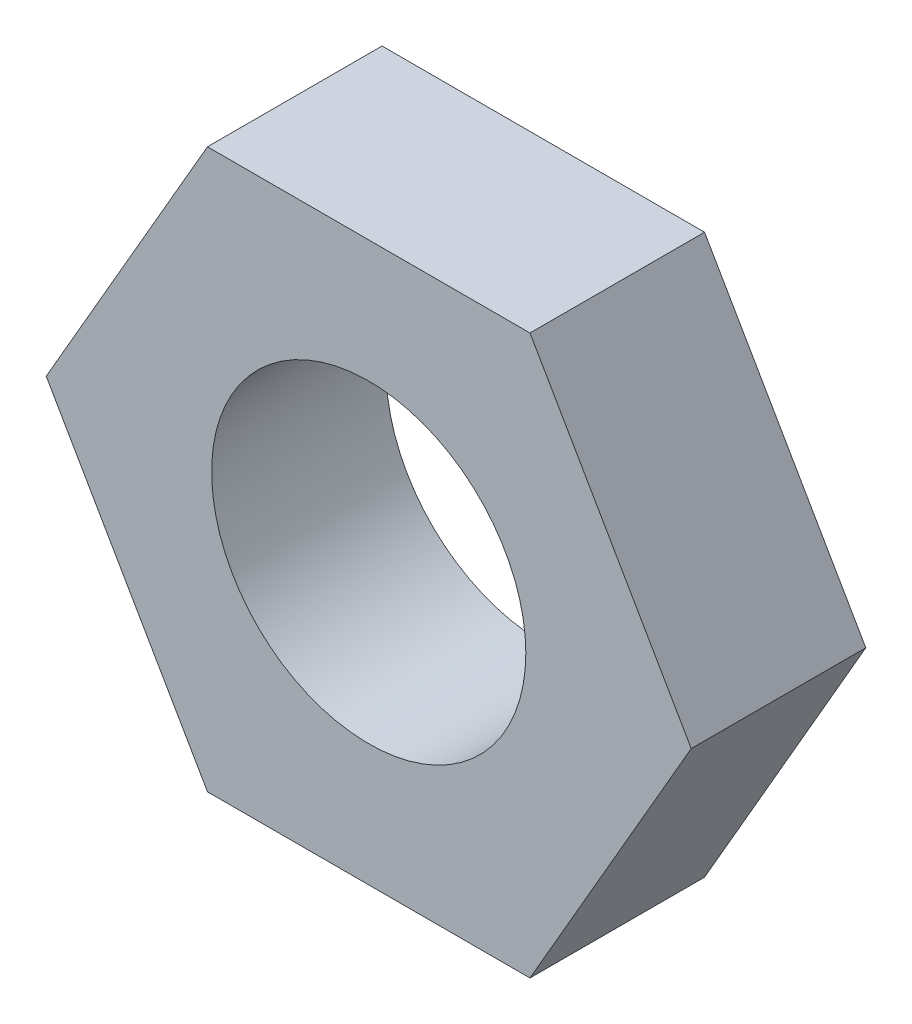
ISO-10303-21;
HEADER;
FILE_DESCRIPTION(('STEP AP214'),'2;1');
FILE_NAME('part.step','',(''),(''),'','','');
FILE_SCHEMA(('AUTOMOTIVE_DESIGN { 1 0 10303 214 1 1 1 1 }'));
ENDSEC;
DATA;
#1=APPLICATION_CONTEXT('core data for automotive mechanical design processes');
#2=APPLICATION_PROTOCOL_DEFINITION('international standard','automotive_design',2000,#1);
#3=PRODUCT_CONTEXT('',#1,'mechanical');
#4=PRODUCT('Part','Part','',(#3));
#5=PRODUCT_RELATED_PRODUCT_CATEGORY('part','',(#4));
#6=PRODUCT_DEFINITION_FORMATION('','',#4);
#7=PRODUCT_DEFINITION_CONTEXT('part definition',#1,'design');
#8=PRODUCT_DEFINITION('design','',#6,#7);
#9=PRODUCT_DEFINITION_SHAPE('','',#8);
#10=(LENGTH_UNIT() NAMED_UNIT(*) SI_UNIT(.MILLI.,.METRE.));
#11=(NAMED_UNIT(*) PLANE_ANGLE_UNIT() SI_UNIT($,.RADIAN.));
#12=(NAMED_UNIT(*) SI_UNIT($,.STERADIAN.) SOLID_ANGLE_UNIT());
#13=UNCERTAINTY_MEASURE_WITH_UNIT(LENGTH_MEASURE(1.E-05),#10,'distance_accuracy_value','');
#14=(GEOMETRIC_REPRESENTATION_CONTEXT(3) GLOBAL_UNCERTAINTY_ASSIGNED_CONTEXT((#13)) GLOBAL_UNIT_ASSIGNED_CONTEXT((#10,
#11,#12)) REPRESENTATION_CONTEXT('',''));
#15=CARTESIAN_POINT('',(0.,0.,0.));
#16=DIRECTION('',(0.,0.,1.));
#17=DIRECTION('',(1.,0.,0.));
#18=AXIS2_PLACEMENT_3D('',#15,#16,#17);
#19=CARTESIAN_POINT('',(-4.618802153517,-8.,-5.));
#20=DIRECTION('',(0.,-1.,0.));
#21=DIRECTION('',(0.,0.,-1.));
#22=AXIS2_PLACEMENT_3D('',#19,#20,#21);
#23=PLANE('',#22);
#24=DIRECTION('',(1.,0.,0.));
#25=VECTOR('',#24,1.);
#26=CARTESIAN_POINT('',(-4.618802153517,-8.,0.));
#27=LINE('',#26,#25);
#28=CARTESIAN_POINT('',(-4.618802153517,-8.,0.));
#29=VERTEX_POINT('',#28);
#30=CARTESIAN_POINT('',(4.61880215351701,-8.,0.));
#31=VERTEX_POINT('',#30);
#32=EDGE_CURVE('E119',#29,#31,#27,.T.);
#33=ORIENTED_EDGE('',*,*,#32,.F.);
#34=DIRECTION('',(0.,0.,1.));
#35=VECTOR('',#34,1.);
#36=CARTESIAN_POINT('',(-4.618802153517,-8.,-5.));
#37=LINE('',#36,#35);
#38=CARTESIAN_POINT('',(-4.618802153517,-8.,-5.));
#39=VERTEX_POINT('',#38);
#40=EDGE_CURVE('E11',#39,#29,#37,.T.);
#41=ORIENTED_EDGE('',*,*,#40,.F.);
#42=DIRECTION('',(1.,0.,0.));
#43=VECTOR('',#42,1.);
#44=CARTESIAN_POINT('',(-4.618802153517,-8.,-5.));
#45=LINE('',#44,#43);
#46=CARTESIAN_POINT('',(4.61880215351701,-8.,-5.));
#47=VERTEX_POINT('',#46);
#48=EDGE_CURVE('E134',#39,#47,#45,.T.);
#49=ORIENTED_EDGE('',*,*,#48,.T.);
#50=DIRECTION('',(0.,0.,1.));
#51=VECTOR('',#50,1.);
#52=CARTESIAN_POINT('',(4.61880215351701,-8.,-5.));
#53=LINE('',#52,#51);
#54=EDGE_CURVE('E37',#47,#31,#53,.T.);
#55=ORIENTED_EDGE('',*,*,#54,.T.);
#56=EDGE_LOOP('',(#33,#41,#49,#55));
#57=FACE_BOUND('',#56,.T.);
#58=ADVANCED_FACE('F34',(#57),#23,.T.);
#59=CARTESIAN_POINT('',(-9.23760430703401,0.,-5.));
#60=DIRECTION('',(-0.866025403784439,-0.5,0.));
#61=DIRECTION('',(0.5,-0.866025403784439,0.));
#62=AXIS2_PLACEMENT_3D('',#59,#60,#61);
#63=PLANE('',#62);
#64=DIRECTION('',(0.5,-0.866025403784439,0.));
#65=VECTOR('',#64,1.);
#66=CARTESIAN_POINT('',(-9.23760430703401,0.,0.));
#67=LINE('',#66,#65);
#68=CARTESIAN_POINT('',(-9.23760430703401,0.,0.));
#69=VERTEX_POINT('',#68);
#70=EDGE_CURVE('E132',#69,#29,#67,.T.);
#71=ORIENTED_EDGE('',*,*,#70,.F.);
#72=DIRECTION('',(0.,0.,1.));
#73=VECTOR('',#72,1.);
#74=CARTESIAN_POINT('',(-9.23760430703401,0.,-5.));
#75=LINE('',#74,#73);
#76=CARTESIAN_POINT('',(-9.23760430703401,0.,-5.));
#77=VERTEX_POINT('',#76);
#78=EDGE_CURVE('E43',#77,#69,#75,.T.);
#79=ORIENTED_EDGE('',*,*,#78,.F.);
#80=DIRECTION('',(0.5,-0.866025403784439,0.));
#81=VECTOR('',#80,1.);
#82=CARTESIAN_POINT('',(-9.23760430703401,0.,-5.));
#83=LINE('',#82,#81);
#84=EDGE_CURVE('E109',#77,#39,#83,.T.);
#85=ORIENTED_EDGE('',*,*,#84,.T.);
#86=ORIENTED_EDGE('',*,*,#40,.T.);
#87=EDGE_LOOP('',(#71,#79,#85,#86));
#88=FACE_BOUND('',#87,.T.);
#89=ADVANCED_FACE('F142',(#88),#63,.T.);
#90=CARTESIAN_POINT('',(-4.61880215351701,8.,-5.));
#91=DIRECTION('',(-0.866025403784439,0.5,0.));
#92=DIRECTION('',(-0.5,-0.866025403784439,0.));
#93=AXIS2_PLACEMENT_3D('',#90,#91,#92);
#94=PLANE('',#93);
#95=DIRECTION('',(-0.5,-0.866025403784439,0.));
#96=VECTOR('',#95,1.);
#97=CARTESIAN_POINT('',(-4.61880215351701,8.,0.));
#98=LINE('',#97,#96);
#99=CARTESIAN_POINT('',(-4.61880215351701,8.,0.));
#100=VERTEX_POINT('',#99);
#101=EDGE_CURVE('E96',#100,#69,#98,.T.);
#102=ORIENTED_EDGE('',*,*,#101,.F.);
#103=DIRECTION('',(0.,0.,1.));
#104=VECTOR('',#103,1.);
#105=CARTESIAN_POINT('',(-4.61880215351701,8.,-5.));
#106=LINE('',#105,#104);
#107=CARTESIAN_POINT('',(-4.61880215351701,8.,-5.));
#108=VERTEX_POINT('',#107);
#109=EDGE_CURVE('E91',#108,#100,#106,.T.);
#110=ORIENTED_EDGE('',*,*,#109,.F.);
#111=DIRECTION('',(-0.5,-0.866025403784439,0.));
#112=VECTOR('',#111,1.);
#113=CARTESIAN_POINT('',(-4.61880215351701,8.,-5.));
#114=LINE('',#113,#112);
#115=EDGE_CURVE('E94',#108,#77,#114,.T.);
#116=ORIENTED_EDGE('',*,*,#115,.T.);
#117=ORIENTED_EDGE('',*,*,#78,.T.);
#118=EDGE_LOOP('',(#102,#110,#116,#117));
#119=FACE_BOUND('',#118,.T.);
#120=ADVANCED_FACE('F93',(#119),#94,.T.);
#121=CARTESIAN_POINT('',(4.61880215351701,8.,-5.));
#122=DIRECTION('',(0.,1.,0.));
#123=DIRECTION('',(0.,0.,1.));
#124=AXIS2_PLACEMENT_3D('',#121,#122,#123);
#125=PLANE('',#124);
#126=DIRECTION('',(-1.,0.,0.));
#127=VECTOR('',#126,1.);
#128=CARTESIAN_POINT('',(4.61880215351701,8.,0.));
#129=LINE('',#128,#127);
#130=CARTESIAN_POINT('',(4.61880215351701,8.,0.));
#131=VERTEX_POINT('',#130);
#132=EDGE_CURVE('E129',#131,#100,#129,.T.);
#133=ORIENTED_EDGE('',*,*,#132,.F.);
#134=DIRECTION('',(0.,0.,1.));
#135=VECTOR('',#134,1.);
#136=CARTESIAN_POINT('',(4.61880215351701,8.,-5.));
#137=LINE('',#136,#135);
#138=CARTESIAN_POINT('',(4.61880215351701,8.,-5.));
#139=VERTEX_POINT('',#138);
#140=EDGE_CURVE('E101',#139,#131,#137,.T.);
#141=ORIENTED_EDGE('',*,*,#140,.F.);
#142=DIRECTION('',(-1.,0.,0.));
#143=VECTOR('',#142,1.);
#144=CARTESIAN_POINT('',(4.61880215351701,8.,-5.));
#145=LINE('',#144,#143);
#146=EDGE_CURVE('E107',#139,#108,#145,.T.);
#147=ORIENTED_EDGE('',*,*,#146,.T.);
#148=ORIENTED_EDGE('',*,*,#109,.T.);
#149=EDGE_LOOP('',(#133,#141,#147,#148));
#150=FACE_BOUND('',#149,.T.);
#151=ADVANCED_FACE('F111',(#150),#125,.T.);
#152=CARTESIAN_POINT('',(9.23760430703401,0.,-5.));
#153=DIRECTION('',(0.866025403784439,0.5,0.));
#154=DIRECTION('',(-0.5,0.866025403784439,0.));
#155=AXIS2_PLACEMENT_3D('',#152,#153,#154);
#156=PLANE('',#155);
#157=DIRECTION('',(-0.5,0.866025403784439,0.));
#158=VECTOR('',#157,1.);
#159=CARTESIAN_POINT('',(9.23760430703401,0.,0.));
#160=LINE('',#159,#158);
#161=CARTESIAN_POINT('',(9.23760430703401,0.,0.));
#162=VERTEX_POINT('',#161);
#163=EDGE_CURVE('E126',#162,#131,#160,.T.);
#164=ORIENTED_EDGE('',*,*,#163,.F.);
#165=DIRECTION('',(0.,0.,1.));
#166=VECTOR('',#165,1.);
#167=CARTESIAN_POINT('',(9.23760430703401,0.,-5.));
#168=LINE('',#167,#166);
#169=CARTESIAN_POINT('',(9.23760430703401,0.,-5.));
#170=VERTEX_POINT('',#169);
#171=EDGE_CURVE('E137',#170,#162,#168,.T.);
#172=ORIENTED_EDGE('',*,*,#171,.F.);
#173=DIRECTION('',(-0.5,0.866025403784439,0.));
#174=VECTOR('',#173,1.);
#175=CARTESIAN_POINT('',(9.23760430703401,0.,-5.));
#176=LINE('',#175,#174);
#177=EDGE_CURVE('E112',#170,#139,#176,.T.);
#178=ORIENTED_EDGE('',*,*,#177,.T.);
#179=ORIENTED_EDGE('',*,*,#140,.T.);
#180=EDGE_LOOP('',(#164,#172,#178,#179));
#181=FACE_BOUND('',#180,.T.);
#182=ADVANCED_FACE('F155',(#181),#156,.T.);
#183=CARTESIAN_POINT('',(4.61880215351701,-8.,-5.));
#184=DIRECTION('',(0.866025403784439,-0.5,0.));
#185=DIRECTION('',(0.5,0.866025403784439,0.));
#186=AXIS2_PLACEMENT_3D('',#183,#184,#185);
#187=PLANE('',#186);
#188=DIRECTION('',(0.5,0.866025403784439,0.));
#189=VECTOR('',#188,1.);
#190=CARTESIAN_POINT('',(4.61880215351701,-8.,0.));
#191=LINE('',#190,#189);
#192=EDGE_CURVE('E122',#31,#162,#191,.T.);
#193=ORIENTED_EDGE('',*,*,#192,.F.);
#194=ORIENTED_EDGE('',*,*,#54,.F.);
#195=DIRECTION('',(0.5,0.866025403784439,0.));
#196=VECTOR('',#195,1.);
#197=CARTESIAN_POINT('',(4.61880215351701,-8.,-5.));
#198=LINE('',#197,#196);
#199=EDGE_CURVE('E114',#47,#170,#198,.T.);
#200=ORIENTED_EDGE('',*,*,#199,.T.);
#201=ORIENTED_EDGE('',*,*,#171,.T.);
#202=EDGE_LOOP('',(#193,#194,#200,#201));
#203=FACE_BOUND('',#202,.T.);
#204=ADVANCED_FACE('F139',(#203),#187,.T.);
#205=CARTESIAN_POINT('',(-4.618802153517,-8.,-5.));
#206=DIRECTION('',(0.,0.,-1.));
#207=DIRECTION('',(-1.,0.,0.));
#208=AXIS2_PLACEMENT_3D('',#205,#206,#207);
#209=PLANE('',#208);
#210=CARTESIAN_POINT('',(0.,0.,-5.));
#211=DIRECTION('',(0.,0.,1.));
#212=DIRECTION('',(1.,0.,0.));
#213=AXIS2_PLACEMENT_3D('',#210,#211,#212);
#214=CIRCLE('',#213,4.5);
#215=CARTESIAN_POINT('',(4.5,0.,-5.));
#216=VERTEX_POINT('',#215);
#217=EDGE_CURVE('E123',#216,#216,#214,.T.);
#218=ORIENTED_EDGE('',*,*,#217,.T.);
#219=EDGE_LOOP('',(#218));
#220=FACE_BOUND('',#219,.T.);
#221=ORIENTED_EDGE('',*,*,#48,.F.);
#222=ORIENTED_EDGE('',*,*,#84,.F.);
#223=ORIENTED_EDGE('',*,*,#115,.F.);
#224=ORIENTED_EDGE('',*,*,#146,.F.);
#225=ORIENTED_EDGE('',*,*,#177,.F.);
#226=ORIENTED_EDGE('',*,*,#199,.F.);
#227=EDGE_LOOP('',(#221,#222,#223,#224,#225,#226));
#228=FACE_BOUND('',#227,.T.);
#229=ADVANCED_FACE('F105',(#220,#228),#209,.T.);
#230=CARTESIAN_POINT('',(-4.618802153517,-8.,0.));
#231=DIRECTION('',(0.,0.,-1.));
#232=DIRECTION('',(-1.,0.,0.));
#233=AXIS2_PLACEMENT_3D('',#230,#231,#232);
#234=PLANE('',#233);
#235=CARTESIAN_POINT('',(0.,0.,0.));
#236=DIRECTION('',(0.,0.,1.));
#237=DIRECTION('',(1.,0.,0.));
#238=AXIS2_PLACEMENT_3D('',#235,#236,#237);
#239=CIRCLE('',#238,4.5);
#240=CARTESIAN_POINT('',(4.5,0.,0.));
#241=VERTEX_POINT('',#240);
#242=EDGE_CURVE('E178',#241,#241,#239,.T.);
#243=ORIENTED_EDGE('',*,*,#242,.F.);
#244=EDGE_LOOP('',(#243));
#245=FACE_BOUND('',#244,.T.);
#246=ORIENTED_EDGE('',*,*,#32,.T.);
#247=ORIENTED_EDGE('',*,*,#192,.T.);
#248=ORIENTED_EDGE('',*,*,#163,.T.);
#249=ORIENTED_EDGE('',*,*,#132,.T.);
#250=ORIENTED_EDGE('',*,*,#101,.T.);
#251=ORIENTED_EDGE('',*,*,#70,.T.);
#252=EDGE_LOOP('',(#246,#247,#248,#249,#250,#251));
#253=FACE_BOUND('',#252,.T.);
#254=ADVANCED_FACE('F141',(#245,#253),#234,.F.);
#255=CARTESIAN_POINT('',(0.,0.,-5.));
#256=DIRECTION('',(0.,0.,1.));
#257=DIRECTION('',(1.,0.,0.));
#258=AXIS2_PLACEMENT_3D('',#255,#256,#257);
#259=CYLINDRICAL_SURFACE('',#258,4.5);
#260=ORIENTED_EDGE('',*,*,#217,.F.);
#261=EDGE_LOOP('',(#260));
#262=FACE_BOUND('',#261,.T.);
#263=ORIENTED_EDGE('',*,*,#242,.T.);
#264=EDGE_LOOP('',(#263));
#265=FACE_BOUND('',#264,.T.);
#266=ADVANCED_FACE('F166',(#262,#265),#259,.F.);
#267=CLOSED_SHELL('',(#58,#89,#120,#151,#182,#204,#229,#254,#266));
#268=MANIFOLD_SOLID_BREP('B2',#267);
#269=ADVANCED_BREP_SHAPE_REPRESENTATION('',(#18,#268),#14);
#270=SHAPE_DEFINITION_REPRESENTATION(#9,#269);
ENDSEC;
END-ISO-10303-21;
